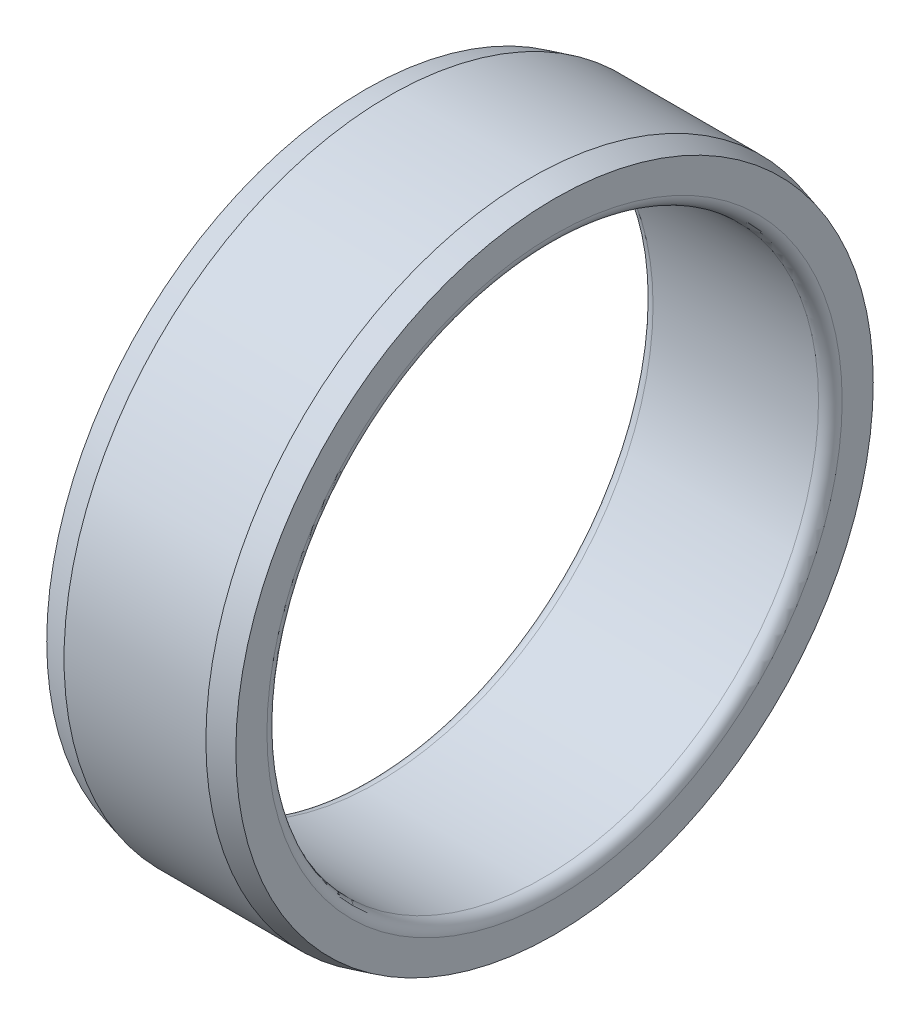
ISO-10303-21;
HEADER;
FILE_DESCRIPTION(('STEP AP214'),'2;1');
FILE_NAME('part.step','',(''),(''),'','','');
FILE_SCHEMA(('AUTOMOTIVE_DESIGN { 1 0 10303 214 1 1 1 1 }'));
ENDSEC;
DATA;
#1=APPLICATION_CONTEXT('core data for automotive mechanical design processes');
#2=APPLICATION_PROTOCOL_DEFINITION('international standard','automotive_design',2000,#1);
#3=PRODUCT_CONTEXT('',#1,'mechanical');
#4=PRODUCT('Part','Part','',(#3));
#5=PRODUCT_RELATED_PRODUCT_CATEGORY('part','',(#4));
#6=PRODUCT_DEFINITION_FORMATION('','',#4);
#7=PRODUCT_DEFINITION_CONTEXT('part definition',#1,'design');
#8=PRODUCT_DEFINITION('design','',#6,#7);
#9=PRODUCT_DEFINITION_SHAPE('','',#8);
#10=(LENGTH_UNIT() NAMED_UNIT(*) SI_UNIT(.MILLI.,.METRE.));
#11=(NAMED_UNIT(*) PLANE_ANGLE_UNIT() SI_UNIT($,.RADIAN.));
#12=(NAMED_UNIT(*) SI_UNIT($,.STERADIAN.) SOLID_ANGLE_UNIT());
#13=UNCERTAINTY_MEASURE_WITH_UNIT(LENGTH_MEASURE(1.E-05),#10,'distance_accuracy_value','');
#14=(GEOMETRIC_REPRESENTATION_CONTEXT(3) GLOBAL_UNCERTAINTY_ASSIGNED_CONTEXT((#13)) GLOBAL_UNIT_ASSIGNED_CONTEXT((#10,
#11,#12)) REPRESENTATION_CONTEXT('',''));
#15=CARTESIAN_POINT('',(0.,0.,0.));
#16=DIRECTION('',(0.,0.,1.));
#17=DIRECTION('',(1.,0.,0.));
#18=AXIS2_PLACEMENT_3D('',#15,#16,#17);
#19=CARTESIAN_POINT('',(12.,0.,0.));
#20=DIRECTION('',(1.,0.,0.));
#21=DIRECTION('',(0.,0.,-1.));
#22=AXIS2_PLACEMENT_3D('',#19,#20,#21);
#23=CYLINDRICAL_SURFACE('',#22,35.);
#24=CARTESIAN_POINT('',(22.5,0.,0.));
#25=DIRECTION('',(1.,0.,0.));
#26=DIRECTION('',(0.,0.,-1.));
#27=AXIS2_PLACEMENT_3D('',#24,#25,#26);
#28=CIRCLE('',#27,35.);
#29=CARTESIAN_POINT('',(22.5,0.,-35.));
#30=VERTEX_POINT('',#29);
#31=EDGE_CURVE('E61',#30,#30,#28,.F.);
#32=ORIENTED_EDGE('',*,*,#31,.F.);
#33=EDGE_LOOP('',(#32));
#34=FACE_BOUND('',#33,.T.);
#35=CARTESIAN_POINT('',(1.5,0.,0.));
#36=DIRECTION('',(1.,0.,0.));
#37=DIRECTION('',(0.,0.,-1.));
#38=AXIS2_PLACEMENT_3D('',#35,#36,#37);
#39=CIRCLE('',#38,35.);
#40=CARTESIAN_POINT('',(1.5,0.,-35.));
#41=VERTEX_POINT('',#40);
#42=EDGE_CURVE('E125',#41,#41,#39,.T.);
#43=ORIENTED_EDGE('',*,*,#42,.F.);
#44=EDGE_LOOP('',(#43));
#45=FACE_BOUND('',#44,.T.);
#46=ADVANCED_FACE('F16',(#34,#45),#23,.F.);
#47=CARTESIAN_POINT('',(1.5,0.,0.));
#48=DIRECTION('',(1.,0.,0.));
#49=DIRECTION('',(0.,0.,-1.));
#50=AXIS2_PLACEMENT_3D('',#47,#48,#49);
#51=TOROIDAL_SURFACE('',#50,36.5,1.5);
#52=ORIENTED_EDGE('',*,*,#42,.T.);
#53=EDGE_LOOP('',(#52));
#54=FACE_BOUND('',#53,.T.);
#55=CARTESIAN_POINT('',(0.,0.,0.));
#56=DIRECTION('',(-1.,0.,0.));
#57=DIRECTION('',(0.,0.,1.));
#58=AXIS2_PLACEMENT_3D('',#55,#56,#57);
#59=CIRCLE('',#58,36.5);
#60=CARTESIAN_POINT('',(0.,36.5,0.));
#61=VERTEX_POINT('',#60);
#62=CARTESIAN_POINT('',(0.,0.,36.5));
#63=VERTEX_POINT('',#62);
#64=EDGE_CURVE('E53',#61,#63,#59,.F.);
#65=ORIENTED_EDGE('',*,*,#64,.F.);
#66=CARTESIAN_POINT('',(0.,0.,0.));
#67=DIRECTION('',(-1.,0.,0.));
#68=DIRECTION('',(0.,1.,0.));
#69=AXIS2_PLACEMENT_3D('',#66,#67,#68);
#70=CIRCLE('',#69,36.5);
#71=CARTESIAN_POINT('',(0.,0.,-36.5));
#72=VERTEX_POINT('',#71);
#73=EDGE_CURVE('E57',#72,#61,#70,.F.);
#74=ORIENTED_EDGE('',*,*,#73,.F.);
#75=CARTESIAN_POINT('',(0.,0.,0.));
#76=DIRECTION('',(-1.,0.,0.));
#77=DIRECTION('',(0.,0.,-1.));
#78=AXIS2_PLACEMENT_3D('',#75,#76,#77);
#79=CIRCLE('',#78,36.5);
#80=EDGE_CURVE('E51',#63,#72,#79,.F.);
#81=ORIENTED_EDGE('',*,*,#80,.F.);
#82=EDGE_LOOP('',(#65,#74,#81));
#83=FACE_BOUND('',#82,.T.);
#84=ADVANCED_FACE('F56',(#54,#83),#51,.T.);
#85=CARTESIAN_POINT('',(22.5,0.,0.));
#86=DIRECTION('',(1.,0.,0.));
#87=DIRECTION('',(0.,0.,-1.));
#88=AXIS2_PLACEMENT_3D('',#85,#86,#87);
#89=TOROIDAL_SURFACE('',#88,36.5,1.5);
#90=ORIENTED_EDGE('',*,*,#31,.T.);
#91=EDGE_LOOP('',(#90));
#92=FACE_BOUND('',#91,.T.);
#93=CARTESIAN_POINT('',(24.,0.,0.));
#94=DIRECTION('',(1.,0.,0.));
#95=DIRECTION('',(0.,0.,1.));
#96=AXIS2_PLACEMENT_3D('',#93,#94,#95);
#97=CIRCLE('',#96,36.5);
#98=CARTESIAN_POINT('',(24.,0.,-36.5));
#99=VERTEX_POINT('',#98);
#100=CARTESIAN_POINT('',(24.,0.,36.5));
#101=VERTEX_POINT('',#100);
#102=EDGE_CURVE('E37',#99,#101,#97,.F.);
#103=ORIENTED_EDGE('',*,*,#102,.F.);
#104=CARTESIAN_POINT('',(24.,0.,0.));
#105=DIRECTION('',(1.,0.,0.));
#106=DIRECTION('',(0.,0.,-1.));
#107=AXIS2_PLACEMENT_3D('',#104,#105,#106);
#108=CIRCLE('',#107,36.5);
#109=CARTESIAN_POINT('',(24.,36.5,0.));
#110=VERTEX_POINT('',#109);
#111=EDGE_CURVE('E135',#110,#99,#108,.F.);
#112=ORIENTED_EDGE('',*,*,#111,.F.);
#113=CARTESIAN_POINT('',(24.,0.,0.));
#114=DIRECTION('',(1.,0.,0.));
#115=DIRECTION('',(0.,1.,0.));
#116=AXIS2_PLACEMENT_3D('',#113,#114,#115);
#117=CIRCLE('',#116,36.5);
#118=EDGE_CURVE('E68',#101,#110,#117,.F.);
#119=ORIENTED_EDGE('',*,*,#118,.F.);
#120=EDGE_LOOP('',(#103,#112,#119));
#121=FACE_BOUND('',#120,.T.);
#122=ADVANCED_FACE('F89',(#92,#121),#89,.T.);
#123=CARTESIAN_POINT('',(0.,38.4730762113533,0.));
#124=DIRECTION('',(-1.,0.,0.));
#125=DIRECTION('',(0.,0.,1.));
#126=AXIS2_PLACEMENT_3D('',#123,#124,#125);
#127=PLANE('',#126);
#128=ORIENTED_EDGE('',*,*,#80,.T.);
#129=ORIENTED_EDGE('',*,*,#73,.T.);
#130=ORIENTED_EDGE('',*,*,#64,.T.);
#131=EDGE_LOOP('',(#128,#129,#130));
#132=FACE_BOUND('',#131,.T.);
#133=CARTESIAN_POINT('',(-1.20237153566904E-10,0.,0.));
#134=DIRECTION('',(1.,0.,0.));
#135=DIRECTION('',(0.,0.,-1.));
#136=AXIS2_PLACEMENT_3D('',#133,#134,#135);
#137=CIRCLE('',#136,40.4461524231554);
#138=CARTESIAN_POINT('',(-1.20236940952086E-10,0.,-40.4461524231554));
#139=VERTEX_POINT('',#138);
#140=EDGE_CURVE('E131',#139,#139,#137,.T.);
#141=ORIENTED_EDGE('',*,*,#140,.F.);
#142=EDGE_LOOP('',(#141));
#143=FACE_BOUND('',#142,.T.);
#144=ADVANCED_FACE('F65',(#132,#143),#127,.T.);
#145=CARTESIAN_POINT('',(24.,38.4730762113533,0.));
#146=DIRECTION('',(1.,0.,0.));
#147=DIRECTION('',(0.,0.,-1.));
#148=AXIS2_PLACEMENT_3D('',#145,#146,#147);
#149=PLANE('',#148);
#150=ORIENTED_EDGE('',*,*,#111,.T.);
#151=ORIENTED_EDGE('',*,*,#102,.T.);
#152=ORIENTED_EDGE('',*,*,#118,.T.);
#153=EDGE_LOOP('',(#150,#151,#152));
#154=FACE_BOUND('',#153,.T.);
#155=CARTESIAN_POINT('',(24.0000000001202,0.,0.));
#156=DIRECTION('',(-1.,0.,0.));
#157=DIRECTION('',(0.,0.,1.));
#158=AXIS2_PLACEMENT_3D('',#155,#156,#157);
#159=CIRCLE('',#158,40.4461524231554);
#160=CARTESIAN_POINT('',(24.0000000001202,0.,40.4461524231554));
#161=VERTEX_POINT('',#160);
#162=EDGE_CURVE('E128',#161,#161,#159,.T.);
#163=ORIENTED_EDGE('',*,*,#162,.F.);
#164=EDGE_LOOP('',(#163));
#165=FACE_BOUND('',#164,.T.);
#166=ADVANCED_FACE('F88',(#154,#165),#149,.T.);
#167=CARTESIAN_POINT('',(3.00000000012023,0.,0.));
#168=DIRECTION('',(1.,0.,0.));
#169=DIRECTION('',(0.,0.,-1.));
#170=AXIS2_PLACEMENT_3D('',#167,#168,#169);
#171=CONICAL_SURFACE('',#170,41.2499999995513,0.261799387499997);
#172=ORIENTED_EDGE('',*,*,#140,.T.);
#173=EDGE_LOOP('',(#172));
#174=FACE_BOUND('',#173,.T.);
#175=CARTESIAN_POINT('',(3.,0.,0.));
#176=DIRECTION('',(1.,0.,0.));
#177=DIRECTION('',(0.,0.,-1.));
#178=AXIS2_PLACEMENT_3D('',#175,#176,#177);
#179=CIRCLE('',#178,41.25);
#180=CARTESIAN_POINT('',(3.,0.,-41.25));
#181=VERTEX_POINT('',#180);
#182=EDGE_CURVE('E28',#181,#181,#179,.T.);
#183=ORIENTED_EDGE('',*,*,#182,.F.);
#184=EDGE_LOOP('',(#183));
#185=FACE_BOUND('',#184,.T.);
#186=ADVANCED_FACE('F181',(#174,#185),#171,.T.);
#187=CARTESIAN_POINT('',(20.9999999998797,0.,0.));
#188=DIRECTION('',(-1.,0.,0.));
#189=DIRECTION('',(0.,0.,1.));
#190=AXIS2_PLACEMENT_3D('',#187,#188,#189);
#191=CONICAL_SURFACE('',#190,41.2499999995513,0.261799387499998);
#192=CARTESIAN_POINT('',(21.,0.,0.));
#193=DIRECTION('',(1.,0.,0.));
#194=DIRECTION('',(0.,0.,-1.));
#195=AXIS2_PLACEMENT_3D('',#192,#193,#194);
#196=CIRCLE('',#195,41.25);
#197=CARTESIAN_POINT('',(21.,0.,-41.25));
#198=VERTEX_POINT('',#197);
#199=EDGE_CURVE('E10',#198,#198,#196,.F.);
#200=ORIENTED_EDGE('',*,*,#199,.F.);
#201=EDGE_LOOP('',(#200));
#202=FACE_BOUND('',#201,.T.);
#203=ORIENTED_EDGE('',*,*,#162,.T.);
#204=EDGE_LOOP('',(#203));
#205=FACE_BOUND('',#204,.T.);
#206=ADVANCED_FACE('F183',(#202,#205),#191,.T.);
#207=CARTESIAN_POINT('',(12.,0.,0.));
#208=DIRECTION('',(1.,0.,0.));
#209=DIRECTION('',(0.,0.,-1.));
#210=AXIS2_PLACEMENT_3D('',#207,#208,#209);
#211=CYLINDRICAL_SURFACE('',#210,41.25);
#212=ORIENTED_EDGE('',*,*,#182,.T.);
#213=EDGE_LOOP('',(#212));
#214=FACE_BOUND('',#213,.T.);
#215=ORIENTED_EDGE('',*,*,#199,.T.);
#216=EDGE_LOOP('',(#215));
#217=FACE_BOUND('',#216,.T.);
#218=ADVANCED_FACE('F18',(#214,#217),#211,.T.);
#219=CLOSED_SHELL('',(#46,#84,#122,#144,#166,#186,#206,#218));
#220=MANIFOLD_SOLID_BREP('B1',#219);
#221=ADVANCED_BREP_SHAPE_REPRESENTATION('',(#18,#220),#14);
#222=SHAPE_DEFINITION_REPRESENTATION(#9,#221);
ENDSEC;
END-ISO-10303-21;
